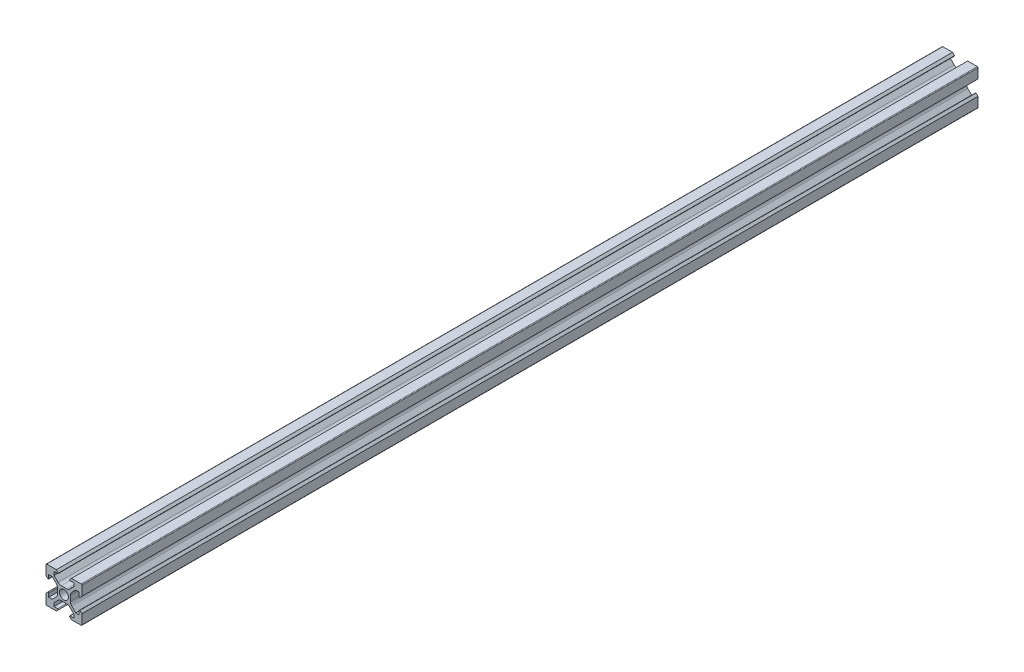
from build123d import *

# Parameters (mm, degrees)
RESSALTO_EXTRUS_O1_DEPTH = 250


with BuildPart() as part:
    # Esbo_o1 → Ressalto-extrus_o1 (new, symmetric)
    with BuildSketch(Plane.XY):
        with BuildLine():
            Line((-3.1, 8.9), (-4.2, 10))
            Line((-4.2, 10), (-9.6, 10))
            ThreePointArc((-9.6, 10), (-9.882842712, 9.882842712), (-10, 9.6))
            Line((-10, 9.6), (-10, 4.2))
            Line((-10, 4.2), (-8.9, 3.1))
            ThreePointArc((-8.9, 3.1), (-8.617157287, 3.217157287), (-8.5, 3.5))
            Line((-8.5, 3.5), (-8.5, 5.5))
            Line((-8.5, 5.5), (-6.560660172, 5.5))
            Line((-6.560660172, 5.5), (-4.332233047, 3.271572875))
            ThreePointArc((-4.332233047, 3.271572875), (-3.790301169, 2.460514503), (-3.6, 1.503805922))
            Line((-3.6, 1.503805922), (-3.6, 0))
            Line((-3.6, 0), (-3.6, -1.503805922))
            ThreePointArc((-3.6, -1.503805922), (-3.790301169, -2.460514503), (-4.332233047, -3.271572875))
            Line((-4.332233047, -3.271572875), (-6.560660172, -5.5))
            Line((-6.560660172, -5.5), (-8.5, -5.5))
            Line((-8.5, -5.5), (-8.5, -3.5))
            ThreePointArc((-8.5, -3.5), (-8.617157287, -3.217157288), (-8.9, -3.1))
            Line((-8.9, -3.1), (-10, -4.2))
            Line((-10, -4.2), (-10, -9.6))
            ThreePointArc((-10, -9.6), (-9.882842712, -9.882842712), (-9.6, -10))
            Line((-9.6, -10), (-4.2, -10))
            Line((-4.2, -10), (-3.1, -8.9))
            ThreePointArc((-3.1, -8.9), (-3.217157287, -8.617157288), (-3.5, -8.5))
            Line((-3.5, -8.5), (-5.5, -8.5))
            Line((-5.5, -8.5), (-5.5, -6.560660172))
            Line((-5.5, -6.560660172), (-3.271572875, -4.332233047))
            ThreePointArc((-3.271572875, -4.332233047), (-2.460514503, -3.790301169), (-1.503805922, -3.6))
            Line((-1.503805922, -3.6), (1.503805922, -3.6))
            ThreePointArc((1.503805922, -3.6), (2.460514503, -3.790301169), (3.271572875, -4.332233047))
            Line((3.271572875, -4.332233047), (5.5, -6.560660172))
            Line((5.5, -6.560660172), (5.5, -8.5))
            Line((5.5, -8.5), (3.5, -8.5))
            ThreePointArc((3.5, -8.5), (3.217157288, -8.617157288), (3.1, -8.9))
            Line((3.1, -8.9), (4.2, -10))
            Line((4.2, -10), (9.6, -10))
            ThreePointArc((9.6, -10), (9.882842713, -9.882842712), (10, -9.6))
            Line((10, -9.6), (10, -4.2))
            Line((10, -4.2), (8.9, -3.1))
            ThreePointArc((8.9, -3.1), (8.617157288, -3.217157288), (8.5, -3.5))
            Line((8.5, -3.5), (8.5, -5.5))
            Line((8.5, -5.5), (6.560660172, -5.5))
            Line((6.560660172, -5.5), (4.332233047, -3.271572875))
            ThreePointArc((4.332233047, -3.271572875), (3.790301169, -2.460514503), (3.6, -1.503805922))
            Line((3.6, -1.503805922), (3.6, 0))
            Line((3.6, 0), (3.6, 1.503805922))
            ThreePointArc((3.6, 1.503805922), (3.790301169, 2.460514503), (4.332233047, 3.271572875))
            Line((4.332233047, 3.271572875), (6.560660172, 5.5))
            Line((6.560660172, 5.5), (8.5, 5.5))
            Line((8.5, 5.5), (8.5, 3.5))
            ThreePointArc((8.5, 3.5), (8.617157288, 3.217157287), (8.9, 3.1))
            Line((8.9, 3.1), (10, 4.2))
            Line((10, 4.2), (10, 9.6))
            ThreePointArc((10, 9.6), (9.882842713, 9.882842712), (9.6, 10))
            Line((9.6, 10), (4.2, 10))
            Line((4.2, 10), (3.1, 8.9))
            ThreePointArc((3.1, 8.9), (3.217157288, 8.617157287), (3.5, 8.5))
            Line((3.5, 8.5), (5.5, 8.5))
            Line((5.5, 8.5), (5.5, 6.560660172))
            Line((5.5, 6.560660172), (3.271572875, 4.332233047))
            ThreePointArc((3.271572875, 4.332233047), (2.460514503, 3.790301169), (1.503805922, 3.6))
            Line((1.503805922, 3.6), (-1.503805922, 3.6))
            ThreePointArc((-1.503805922, 3.6), (-2.460514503, 3.790301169), (-3.271572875, 4.332233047))
            Line((-3.271572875, 4.332233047), (-5.5, 6.560660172))
            Line((-5.5, 6.560660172), (-5.5, 8.5))
            Line((-5.5, 8.5), (-3.5, 8.5))
            ThreePointArc((-3.5, 8.5), (-3.217157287, 8.617157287), (-3.1, 8.9))
        make_face()
        with BuildLine():
            ThreePointArc((2.5, 0), (0, 2.5), (-2.5, 0))
            ThreePointArc((-2.5, 0), (0, -2.5), (2.5, 0))
        make_face(mode=Mode.SUBTRACT)
    extrude(amount=RESSALTO_EXTRUS_O1_DEPTH, both=True)


solid = part.part
